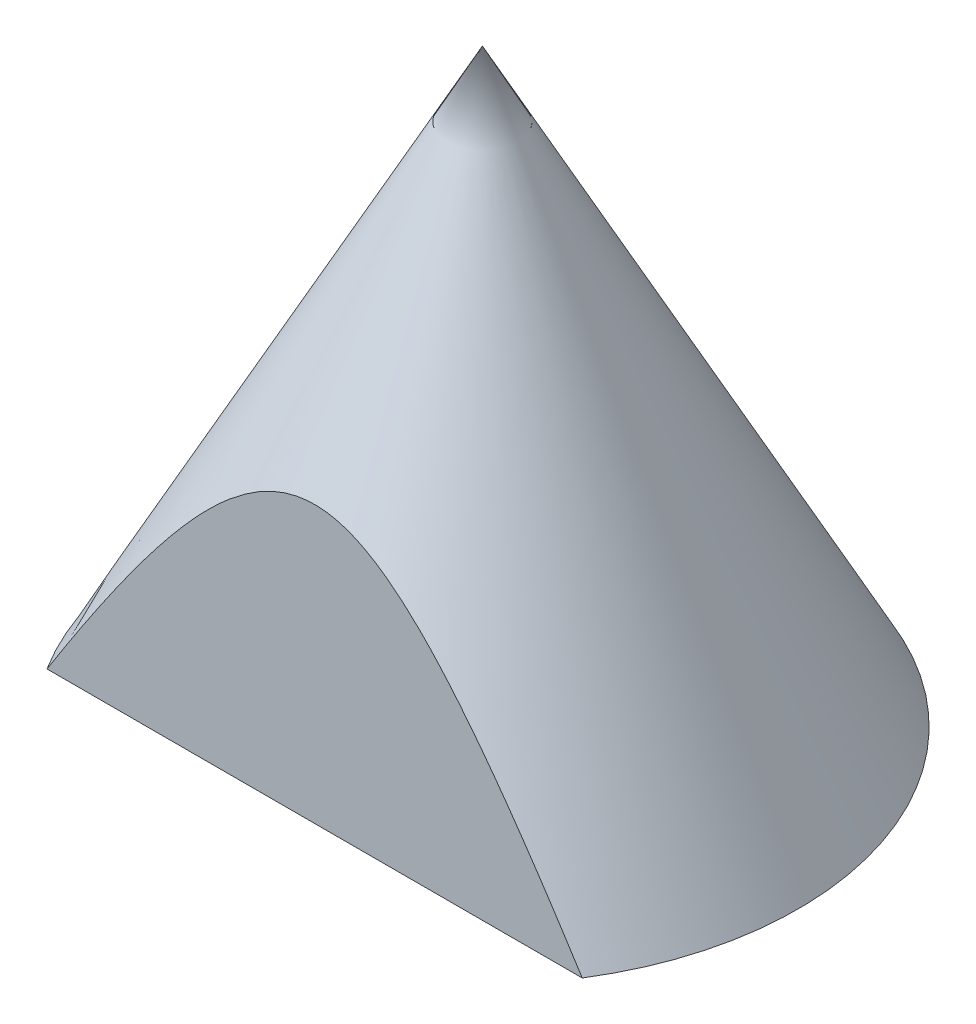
ISO-10303-21;
HEADER;
FILE_DESCRIPTION(('STEP AP214'),'2;1');
FILE_NAME('part.step','',(''),(''),'','','');
FILE_SCHEMA(('AUTOMOTIVE_DESIGN { 1 0 10303 214 1 1 1 1 }'));
ENDSEC;
DATA;
#1=APPLICATION_CONTEXT('core data for automotive mechanical design processes');
#2=APPLICATION_PROTOCOL_DEFINITION('international standard','automotive_design',2000,#1);
#3=PRODUCT_CONTEXT('',#1,'mechanical');
#4=PRODUCT('Part','Part','',(#3));
#5=PRODUCT_RELATED_PRODUCT_CATEGORY('part','',(#4));
#6=PRODUCT_DEFINITION_FORMATION('','',#4);
#7=PRODUCT_DEFINITION_CONTEXT('part definition',#1,'design');
#8=PRODUCT_DEFINITION('design','',#6,#7);
#9=PRODUCT_DEFINITION_SHAPE('','',#8);
#10=(LENGTH_UNIT() NAMED_UNIT(*) SI_UNIT(.MILLI.,.METRE.));
#11=(NAMED_UNIT(*) PLANE_ANGLE_UNIT() SI_UNIT($,.RADIAN.));
#12=(NAMED_UNIT(*) SI_UNIT($,.STERADIAN.) SOLID_ANGLE_UNIT());
#13=UNCERTAINTY_MEASURE_WITH_UNIT(LENGTH_MEASURE(1.E-05),#10,'distance_accuracy_value','');
#14=(GEOMETRIC_REPRESENTATION_CONTEXT(3) GLOBAL_UNCERTAINTY_ASSIGNED_CONTEXT((#13)) GLOBAL_UNIT_ASSIGNED_CONTEXT((#10,
#11,#12)) REPRESENTATION_CONTEXT('',''));
#15=CARTESIAN_POINT('',(0.,0.,0.));
#16=DIRECTION('',(0.,0.,1.));
#17=DIRECTION('',(1.,0.,0.));
#18=AXIS2_PLACEMENT_3D('',#15,#16,#17);
#19=CARTESIAN_POINT('',(-30.4000908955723,3.11822558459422,0.));
#20=DIRECTION('',(0.,1.,0.));
#21=DIRECTION('',(0.,0.,1.));
#22=AXIS2_PLACEMENT_3D('',#19,#20,#21);
#23=PLANE('',#22);
#24=CARTESIAN_POINT('',(0.,3.11822558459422,0.));
#25=DIRECTION('',(0.,-1.,0.));
#26=DIRECTION('',(0.,0.,-1.));
#27=AXIS2_PLACEMENT_3D('',#24,#25,#26);
#28=CIRCLE('',#27,30.4000908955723);
#29=CARTESIAN_POINT('',(-25.7566053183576,3.11822558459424,16.1481518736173));
#30=VERTEX_POINT('',#29);
#31=CARTESIAN_POINT('',(25.7566053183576,3.11822558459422,16.1481518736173));
#32=VERTEX_POINT('',#31);
#33=EDGE_CURVE('E42',#30,#32,#28,.T.);
#34=ORIENTED_EDGE('',*,*,#33,.T.);
#35=DIRECTION('',(1.,0.,0.));
#36=VECTOR('',#35,1.);
#37=CARTESIAN_POINT('',(-30.,3.11822558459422,16.1481518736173));
#38=LINE('',#37,#36);
#39=EDGE_CURVE('E48',#30,#32,#38,.T.);
#40=ORIENTED_EDGE('',*,*,#39,.F.);
#41=EDGE_LOOP('',(#34,#40));
#42=FACE_BOUND('',#41,.T.);
#43=ADVANCED_FACE('F31',(#42),#23,.F.);
#44=CARTESIAN_POINT('',(0.,59.8402338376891,0.));
#45=DIRECTION('',(0.,-1.,0.));
#46=DIRECTION('',(0.,0.,-1.));
#47=AXIS2_PLACEMENT_3D('',#44,#45,#46);
#48=CONICAL_SURFACE('',#47,0.,0.491991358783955);
#49=ORIENTED_EDGE('',*,*,#33,.F.);
#50=CARTESIAN_POINT('',(-40.8982517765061,-22.2026507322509,16.1481518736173));
#51=CARTESIAN_POINT('',(-40.1341032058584,-20.8765787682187,16.1481518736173));
#52=CARTESIAN_POINT('',(-39.3678550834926,-19.5517115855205,16.1481518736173));
#53=CARTESIAN_POINT('',(-37.8302135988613,-16.9049393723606,16.1481518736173));
#54=CARTESIAN_POINT('',(-37.0588201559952,-15.5830343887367,16.1481518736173));
#55=CARTESIAN_POINT('',(-35.5094929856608,-12.9419748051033,16.1481518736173));
#56=CARTESIAN_POINT('',(-34.7315555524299,-11.622822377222,16.1481518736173));
#57=CARTESIAN_POINT('',(-33.1683482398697,-8.98887712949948,16.1481518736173));
#58=CARTESIAN_POINT('',(-32.3830784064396,-7.67408428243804,16.1481518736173));
#59=CARTESIAN_POINT('',(-30.7992096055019,-5.04262621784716,16.1481518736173));
#60=CARTESIAN_POINT('',(-30.0005609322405,-3.72599088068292,16.1481518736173));
#61=CARTESIAN_POINT('',(-28.3920091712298,-1.09961998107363,16.1481518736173));
#62=CARTESIAN_POINT('',(-27.5821061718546,0.210115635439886,16.1481518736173));
#63=CARTESIAN_POINT('',(-25.9482930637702,2.82033042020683,16.1481518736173));
#64=CARTESIAN_POINT('',(-25.1243870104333,4.12081211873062,16.1481518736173));
#65=CARTESIAN_POINT('',(-23.8746904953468,6.06260502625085,16.1481518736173));
#66=CARTESIAN_POINT('',(-23.4558236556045,6.70837366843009,16.1481518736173));
#67=CARTESIAN_POINT('',(-22.6127613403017,7.99642123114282,16.1481518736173));
#68=CARTESIAN_POINT('',(-22.1885659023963,8.63870017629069,16.1481518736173));
#69=CARTESIAN_POINT('',(-21.3841938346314,9.84394632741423,16.1481518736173));
#70=CARTESIAN_POINT('',(-21.0046990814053,10.4073683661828,16.1481518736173));
#71=CARTESIAN_POINT('',(-20.240198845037,11.530467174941,16.1481518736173));
#72=CARTESIAN_POINT('',(-19.8551933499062,12.0901439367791,16.1481518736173));
#73=CARTESIAN_POINT('',(-19.0787070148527,13.2052412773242,16.1481518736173));
#74=CARTESIAN_POINT('',(-18.6872242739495,13.7606605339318,16.1481518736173));
#75=CARTESIAN_POINT('',(-17.8968571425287,14.8662098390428,16.1481518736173));
#76=CARTESIAN_POINT('',(-17.4979728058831,15.4163399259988,16.1481518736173));
#77=CARTESIAN_POINT('',(-16.6908102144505,16.5111568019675,16.1481518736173));
#78=CARTESIAN_POINT('',(-16.2825168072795,17.0558324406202,16.1481518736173));
#79=CARTESIAN_POINT('',(-15.4555717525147,18.1373194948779,16.1481518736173));
#80=CARTESIAN_POINT('',(-15.0369196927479,18.6741305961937,16.1481518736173));
#81=CARTESIAN_POINT('',(-14.187441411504,19.7376038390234,16.1481518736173));
#82=CARTESIAN_POINT('',(-13.7566215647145,20.2642710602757,16.1481518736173));
#83=CARTESIAN_POINT('',(-12.8800145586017,21.3049867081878,16.1481518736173));
#84=CARTESIAN_POINT('',(-12.4342290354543,21.8190365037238,16.1481518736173));
#85=CARTESIAN_POINT('',(-11.7499049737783,22.5797516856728,16.1481518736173));
#86=CARTESIAN_POINT('',(-11.5182243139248,22.8325938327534,16.1481518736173));
#87=CARTESIAN_POINT('',(-11.0496437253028,23.3333878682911,16.1481518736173));
#88=CARTESIAN_POINT('',(-10.8127440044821,23.5813399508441,16.1481518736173));
#89=CARTESIAN_POINT('',(-10.332968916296,24.0717025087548,16.1481518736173));
#90=CARTESIAN_POINT('',(-10.0900899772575,24.3141094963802,16.1481518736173));
#91=CARTESIAN_POINT('',(-9.59780649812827,24.7922144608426,16.1481518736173));
#92=CARTESIAN_POINT('',(-9.34840205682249,25.0279125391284,16.1481518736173));
#93=CARTESIAN_POINT('',(-8.84338939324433,25.4903392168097,16.1481518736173));
#94=CARTESIAN_POINT('',(-8.58781300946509,25.7171024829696,16.1481518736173));
#95=CARTESIAN_POINT('',(-8.06853615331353,26.1612119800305,16.1481518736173));
#96=CARTESIAN_POINT('',(-7.80483497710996,26.3785573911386,16.1481518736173));
#97=CARTESIAN_POINT('',(-7.26869619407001,26.801631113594,16.1481518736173));
#98=CARTESIAN_POINT('',(-6.99626830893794,27.0073716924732,16.1481518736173));
#99=CARTESIAN_POINT('',(-6.44152933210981,27.4049913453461,16.1481518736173));
#100=CARTESIAN_POINT('',(-6.15922107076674,27.5968743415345,16.1481518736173));
#101=CARTESIAN_POINT('',(-5.62341000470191,27.9384984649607,16.1481518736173));
#102=CARTESIAN_POINT('',(-5.37129241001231,28.0904044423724,16.1481518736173));
#103=CARTESIAN_POINT('',(-4.85858754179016,28.379272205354,16.1481518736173));
#104=CARTESIAN_POINT('',(-4.59800045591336,28.5162343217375,16.1481518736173));
#105=CARTESIAN_POINT('',(-4.06831775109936,28.7723672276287,16.1481518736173));
#106=CARTESIAN_POINT('',(-3.79922635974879,28.8915466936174,16.1481518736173));
#107=CARTESIAN_POINT('',(-3.2526805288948,29.1090850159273,16.1481518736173));
#108=CARTESIAN_POINT('',(-2.97522605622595,29.2074437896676,16.1481518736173));
#109=CARTESIAN_POINT('',(-2.4085057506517,29.3814437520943,16.1481518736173));
#110=CARTESIAN_POINT('',(-2.11912369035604,29.4567107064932,16.1481518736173));
#111=CARTESIAN_POINT('',(-1.53445922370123,29.5793305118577,16.1481518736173));
#112=CARTESIAN_POINT('',(-1.23917735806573,29.6266859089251,16.1481518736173));
#113=CARTESIAN_POINT('',(-0.645645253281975,29.6911914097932,16.1481518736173));
#114=CARTESIAN_POINT('',(-0.347398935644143,29.7083771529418,16.1481518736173));
#115=CARTESIAN_POINT('',(0.249259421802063,29.711755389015,16.1481518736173));
#116=CARTESIAN_POINT('',(0.547671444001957,29.697950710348,16.1481518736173));
#117=CARTESIAN_POINT('',(1.09792755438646,29.6443398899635,16.1481518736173));
#118=CARTESIAN_POINT('',(1.35018531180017,29.6086421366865,16.1481518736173));
#119=CARTESIAN_POINT('',(1.85088734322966,29.5164966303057,16.1481518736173));
#120=CARTESIAN_POINT('',(2.09933119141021,29.4600465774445,16.1481518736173));
#121=CARTESIAN_POINT('',(2.59118910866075,29.3281507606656,16.1481518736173));
#122=CARTESIAN_POINT('',(2.83460111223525,29.2526973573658,16.1481518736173));
#123=CARTESIAN_POINT('',(3.31549198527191,29.0848526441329,16.1481518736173));
#124=CARTESIAN_POINT('',(3.552969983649,28.9924588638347,16.1481518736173));
#125=CARTESIAN_POINT('',(4.18374071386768,28.7237247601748,16.1481518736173));
#126=CARTESIAN_POINT('',(4.57115543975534,28.5335329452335,16.1481518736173));
#127=CARTESIAN_POINT('',(5.32777995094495,28.1198555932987,16.1481518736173));
#128=CARTESIAN_POINT('',(5.69697544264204,27.8963444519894,16.1481518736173));
#129=CARTESIAN_POINT('',(6.41987350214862,27.4225962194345,16.1481518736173));
#130=CARTESIAN_POINT('',(6.77350527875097,27.1722518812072,16.1481518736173));
#131=CARTESIAN_POINT('',(7.29236902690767,26.7816852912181,16.1481518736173));
#132=CARTESIAN_POINT('',(7.463371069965,26.6490066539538,16.1481518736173));
#133=CARTESIAN_POINT('',(7.8018039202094,26.3791635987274,16.1481518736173));
#134=CARTESIAN_POINT('',(7.96923472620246,26.2419991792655,16.1481518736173));
#135=CARTESIAN_POINT('',(8.41639744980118,25.8666287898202,16.1481518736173));
#136=CARTESIAN_POINT('',(8.69299372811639,25.6246847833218,16.1481518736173));
#137=CARTESIAN_POINT('',(9.23767878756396,25.1313700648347,16.1481518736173));
#138=CARTESIAN_POINT('',(9.50576626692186,24.8799979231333,16.1481518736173));
#139=CARTESIAN_POINT('',(10.0345119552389,24.3692997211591,16.1481518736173));
#140=CARTESIAN_POINT('',(10.2951661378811,24.1099695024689,16.1481518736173));
#141=CARTESIAN_POINT('',(10.8097686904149,23.5847226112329,16.1481518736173));
#142=CARTESIAN_POINT('',(11.0637166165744,23.3188055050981,16.1481518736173));
#143=CARTESIAN_POINT('',(11.5662151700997,22.7807851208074,16.1481518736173));
#144=CARTESIAN_POINT('',(11.8147520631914,22.5086690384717,16.1481518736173));
#145=CARTESIAN_POINT('',(12.3064797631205,21.9596424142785,16.1481518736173));
#146=CARTESIAN_POINT('',(12.5496703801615,21.6827317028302,16.1481518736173));
#147=CARTESIAN_POINT('',(13.2719355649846,20.846010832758,16.1481518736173));
#148=CARTESIAN_POINT('',(13.7438706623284,20.2800311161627,16.1481518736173));
#149=CARTESIAN_POINT('',(14.6772009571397,19.1296601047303,16.1481518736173));
#150=CARTESIAN_POINT('',(15.1384339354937,18.5451380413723,16.1481518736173));
#151=CARTESIAN_POINT('',(16.0480687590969,17.3661638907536,16.1481518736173));
#152=CARTESIAN_POINT('',(16.4964698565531,16.7717112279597,16.1481518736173));
#153=CARTESIAN_POINT('',(17.381943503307,15.575853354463,16.1481518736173));
#154=CARTESIAN_POINT('',(17.8190323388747,14.9744601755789,16.1481518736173));
#155=CARTESIAN_POINT('',(18.4679718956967,14.0676097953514,16.1481518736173));
#156=CARTESIAN_POINT('',(18.6831666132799,13.7645370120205,16.1481518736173));
#157=CARTESIAN_POINT('',(19.1115031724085,13.1569439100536,16.1481518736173));
#158=CARTESIAN_POINT('',(19.3246450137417,12.8524235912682,16.1481518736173));
#159=CARTESIAN_POINT('',(19.9703938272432,11.9237299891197,16.1481518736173));
#160=CARTESIAN_POINT('',(20.4000065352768,11.297473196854,16.1481518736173));
#161=CARTESIAN_POINT('',(21.2525250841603,10.0404059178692,16.1481518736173));
#162=CARTESIAN_POINT('',(21.675430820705,9.40959536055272,16.1481518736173));
#163=CARTESIAN_POINT('',(22.5154907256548,8.14411089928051,16.1481518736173));
#164=CARTESIAN_POINT('',(22.9326445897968,7.50943679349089,16.1481518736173));
#165=CARTESIAN_POINT('',(23.7619431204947,6.2368223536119,16.1481518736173));
#166=CARTESIAN_POINT('',(24.1740877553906,5.5988819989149,16.1481518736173));
#167=CARTESIAN_POINT('',(25.4041734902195,3.68058414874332,16.1481518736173));
#168=CARTESIAN_POINT('',(26.2155786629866,2.39603407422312,16.1481518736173));
#169=CARTESIAN_POINT('',(27.8248517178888,-0.18144444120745,16.1481518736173));
#170=CARTESIAN_POINT('',(28.6227199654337,-1.47437265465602,16.1481518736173));
#171=CARTESIAN_POINT('',(30.2089605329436,-4.06882484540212,16.1481518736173));
#172=CARTESIAN_POINT('',(30.9973159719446,-5.37035913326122,16.1481518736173));
#173=CARTESIAN_POINT('',(32.5653282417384,-7.97866134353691,16.1481518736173));
#174=CARTESIAN_POINT('',(33.3449850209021,-9.28542929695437,16.1481518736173));
#175=CARTESIAN_POINT('',(34.8970549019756,-11.9030222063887,16.1481518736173));
#176=CARTESIAN_POINT('',(35.6694689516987,-13.2138466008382,16.1481518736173));
#177=CARTESIAN_POINT('',(37.208362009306,-15.838968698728,16.1481518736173));
#178=CARTESIAN_POINT('',(37.9748410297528,-17.1532663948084,16.1481518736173));
#179=CARTESIAN_POINT('',(39.4407435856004,-19.6778642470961,16.1481518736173));
#180=CARTESIAN_POINT('',(40.1405559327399,-20.8879387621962,16.1481518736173));
#181=CARTESIAN_POINT('',(41.5365537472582,-23.3101785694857,16.1481518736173));
#182=CARTESIAN_POINT('',(42.2327392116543,-24.5223438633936,16.1481518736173));
#183=CARTESIAN_POINT('',(44.3166559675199,-28.1616207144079,16.1481518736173));
#184=CARTESIAN_POINT('',(45.6996936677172,-30.5914201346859,16.1481518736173));
#185=CARTESIAN_POINT('',(48.4526608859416,-35.4501820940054,16.1481518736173));
#186=CARTESIAN_POINT('',(49.822614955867,-37.8791307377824,16.1481518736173));
#187=CARTESIAN_POINT('',(51.8718944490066,-41.5256466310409,16.1481518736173));
#188=CARTESIAN_POINT('',(52.5540285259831,-42.7416366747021,16.1481518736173));
#189=CARTESIAN_POINT('',(53.9166160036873,-45.1745567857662,16.1481518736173));
#190=CARTESIAN_POINT('',(54.5970694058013,-46.3914868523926,16.1481518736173));
#191=CARTESIAN_POINT('',(55.2767787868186,-47.6088322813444,16.1481518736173));
#192=B_SPLINE_CURVE_WITH_KNOTS('',3,(#50,#51,#52,#53,#54,#55,#56,#57,#58,#59,#60,#61,#62,#63,
#64,#65,#66,#67,#68,#69,#70,#71,#72,#73,#74,#75,#76,#77,#78,#79,#80,#81,#82,#83,#84,#85,#86,#87,
#88,#89,#90,#91,#92,#93,#94,#95,#96,#97,#98,#99,#100,#101,#102,#103,#104,#105,#106,#107,#108,
#109,#110,#111,#112,#113,#114,#115,#116,#117,#118,#119,#120,#121,#122,#123,#124,#125,#126,#127,
#128,#129,#130,#131,#132,#133,#134,#135,#136,#137,#138,#139,#140,#141,#142,#143,#144,#145,#146,
#147,#148,#149,#150,#151,#152,#153,#154,#155,#156,#157,#158,#159,#160,#161,#162,#163,#164,#165,
#166,#167,#168,#169,#170,#171,#172,#173,#174,#175,#176,#177,#178,#179,#180,#181,#182,#183,#184,
#185,#186,#187,#188,#189,#190,#191),.UNSPECIFIED.,.F.,.F.,(4,2,2,2,2,2,2,2,2,2,2,2,2,2,2,2,2,2,
2,2,2,2,2,2,2,2,2,2,2,2,2,2,2,2,2,2,2,2,2,2,2,2,2,2,2,2,2,2,2,2,2,2,2,2,2,2,2,2,2,2,2,2,2,2,2,2,
2,2,2,2,4),(0.,4.59146509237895,9.18300227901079,13.7773429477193,18.371654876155,
22.9913831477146,27.6110751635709,32.2294513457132,34.538586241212,36.8477048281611,
38.8856041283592,40.923507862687,42.9620206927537,45.0005186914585,47.0425674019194,
49.0846974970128,51.1257768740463,53.1666338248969,54.1953819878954,55.2240892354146,
56.2534266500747,57.2827484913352,58.3075764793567,59.3324934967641,60.3563059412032,
61.3798274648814,62.2624353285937,63.1450236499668,64.0271799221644,64.9093396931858,
65.8051209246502,66.7008204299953,67.5954611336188,68.4900201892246,69.2534401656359,
70.0169447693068,70.7807567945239,71.5446802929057,72.8371598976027,74.1306378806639,
75.4294933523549,76.0787490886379,76.7280050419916,77.8301680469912,78.932498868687,
80.0354158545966,81.1384056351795,82.2439284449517,83.3494904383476,85.5598760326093,
87.7934186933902,90.027091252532,92.2573455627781,93.3724426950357,94.4875399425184,
96.7658334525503,99.0441623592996,101.322611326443,103.601074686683,108.159023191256,
112.716848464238,117.281831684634,121.846841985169,126.411246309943,130.975640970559,
135.169219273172,139.362801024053,147.750287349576,156.116219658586,160.298974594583,
164.481726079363),.UNSPECIFIED.);
#193=EDGE_CURVE('E11',#30,#32,#192,.T.);
#194=ORIENTED_EDGE('',*,*,#193,.T.);
#195=EDGE_LOOP('',(#49,#194));
#196=FACE_BOUND('',#195,.T.);
#197=CARTESIAN_POINT('',(0.,59.8402338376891,0.));
#198=VERTEX_POINT('',#197);
#199=VERTEX_LOOP('',#198);
#200=FACE_BOUND('',#199,.T.);
#201=ADVANCED_FACE('F59',(#196,#200),#48,.T.);
#202=CARTESIAN_POINT('',(-30.,29.7102053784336,16.1481518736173));
#203=DIRECTION('',(0.,0.,-1.));
#204=DIRECTION('',(-1.,0.,0.));
#205=AXIS2_PLACEMENT_3D('',#202,#203,#204);
#206=PLANE('',#205);
#207=ORIENTED_EDGE('',*,*,#39,.T.);
#208=ORIENTED_EDGE('',*,*,#193,.F.);
#209=EDGE_LOOP('',(#207,#208));
#210=FACE_BOUND('',#209,.T.);
#211=ADVANCED_FACE('F53',(#210),#206,.F.);
#212=CLOSED_SHELL('',(#43,#201,#211));
#213=MANIFOLD_SOLID_BREP('B2',#212);
#214=ADVANCED_BREP_SHAPE_REPRESENTATION('',(#18,#213),#14);
#215=SHAPE_DEFINITION_REPRESENTATION(#9,#214);
ENDSEC;
END-ISO-10303-21;
